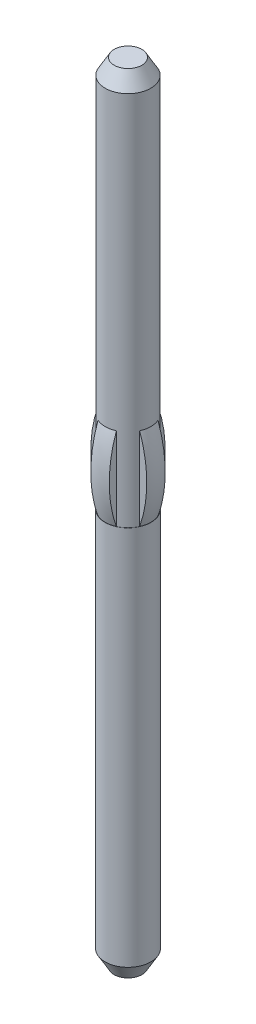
ISO-10303-21;
HEADER;
FILE_DESCRIPTION(('STEP AP214'),'2;1');
FILE_NAME('part.step','',(''),(''),'','','');
FILE_SCHEMA(('AUTOMOTIVE_DESIGN { 1 0 10303 214 1 1 1 1 }'));
ENDSEC;
DATA;
#1=APPLICATION_CONTEXT('core data for automotive mechanical design processes');
#2=APPLICATION_PROTOCOL_DEFINITION('international standard','automotive_design',2000,#1);
#3=PRODUCT_CONTEXT('',#1,'mechanical');
#4=PRODUCT('Part','Part','',(#3));
#5=PRODUCT_RELATED_PRODUCT_CATEGORY('part','',(#4));
#6=PRODUCT_DEFINITION_FORMATION('','',#4);
#7=PRODUCT_DEFINITION_CONTEXT('part definition',#1,'design');
#8=PRODUCT_DEFINITION('design','',#6,#7);
#9=PRODUCT_DEFINITION_SHAPE('','',#8);
#10=(LENGTH_UNIT() NAMED_UNIT(*) SI_UNIT(.MILLI.,.METRE.));
#11=(NAMED_UNIT(*) PLANE_ANGLE_UNIT() SI_UNIT($,.RADIAN.));
#12=(NAMED_UNIT(*) SI_UNIT($,.STERADIAN.) SOLID_ANGLE_UNIT());
#13=UNCERTAINTY_MEASURE_WITH_UNIT(LENGTH_MEASURE(1.E-05),#10,'distance_accuracy_value','');
#14=(GEOMETRIC_REPRESENTATION_CONTEXT(3) GLOBAL_UNCERTAINTY_ASSIGNED_CONTEXT((#13)) GLOBAL_UNIT_ASSIGNED_CONTEXT((#10,
#11,#12)) REPRESENTATION_CONTEXT('',''));
#15=CARTESIAN_POINT('',(0.,0.,0.));
#16=DIRECTION('',(0.,0.,1.));
#17=DIRECTION('',(1.,0.,0.));
#18=AXIS2_PLACEMENT_3D('',#15,#16,#17);
#19=CARTESIAN_POINT('',(-1.837552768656,-3.652,-0.8375527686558));
#20=DIRECTION('',(0.,-1.,0.));
#21=DIRECTION('',(-1.,0.,0.));
#22=AXIS2_PLACEMENT_3D('',#19,#20,#21);
#23=PLANE('',#22);
#24=CARTESIAN_POINT('',(-2.,-3.65200000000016,-1.));
#25=DIRECTION('',(0.,1.,0.));
#26=DIRECTION('',(0.,0.,1.));
#27=AXIS2_PLACEMENT_3D('',#24,#25,#26);
#28=CIRCLE('',#27,0.151154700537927);
#29=CARTESIAN_POINT('',(-2.,-3.65200000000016,-0.848845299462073));
#30=VERTEX_POINT('',#29);
#31=EDGE_CURVE('E21',#30,#30,#28,.F.);
#32=ORIENTED_EDGE('',*,*,#31,.T.);
#33=EDGE_LOOP('',(#32));
#34=FACE_BOUND('',#33,.T.);
#35=ADVANCED_FACE('F16',(#34),#23,.T.);
#36=CARTESIAN_POINT('',(-2.,-3.48252697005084,-1.));
#37=DIRECTION('',(0.,1.,0.));
#38=DIRECTION('',(0.,0.,1.));
#39=AXIS2_PLACEMENT_3D('',#36,#37,#38);
#40=CONICAL_SURFACE('',#39,0.249000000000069,0.523598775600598);
#41=ORIENTED_EDGE('',*,*,#31,.F.);
#42=EDGE_LOOP('',(#41));
#43=FACE_BOUND('',#42,.T.);
#44=CARTESIAN_POINT('',(-2.,-3.48252697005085,-1.));
#45=DIRECTION('',(0.,-1.,0.));
#46=DIRECTION('',(-1.,0.,0.));
#47=AXIS2_PLACEMENT_3D('',#44,#45,#46);
#48=CIRCLE('',#47,0.249);
#49=CARTESIAN_POINT('',(-2.249,-3.48252697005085,-1.));
#50=VERTEX_POINT('',#49);
#51=EDGE_CURVE('E88',#50,#50,#48,.T.);
#52=ORIENTED_EDGE('',*,*,#51,.T.);
#53=EDGE_LOOP('',(#52));
#54=FACE_BOUND('',#53,.T.);
#55=ADVANCED_FACE('F287',(#43,#54),#40,.T.);
#56=CARTESIAN_POINT('',(-2.,0.649999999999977,-1.));
#57=DIRECTION('',(0.,-1.,0.));
#58=DIRECTION('',(0.,0.,-1.));
#59=AXIS2_PLACEMENT_3D('',#56,#57,#58);
#60=CYLINDRICAL_SURFACE('',#59,0.249);
#61=ORIENTED_EDGE('',*,*,#51,.F.);
#62=EDGE_LOOP('',(#61));
#63=FACE_BOUND('',#62,.T.);
#64=CARTESIAN_POINT('',(-2.,0.649999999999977,-1.));
#65=DIRECTION('',(0.,-1.,0.));
#66=DIRECTION('',(0.,0.,-1.));
#67=AXIS2_PLACEMENT_3D('',#64,#65,#66);
#68=CIRCLE('',#67,0.249);
#69=CARTESIAN_POINT('',(-2.,0.649999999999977,-1.249));
#70=VERTEX_POINT('',#69);
#71=EDGE_CURVE('E97',#70,#70,#68,.T.);
#72=ORIENTED_EDGE('',*,*,#71,.T.);
#73=EDGE_LOOP('',(#72));
#74=FACE_BOUND('',#73,.T.);
#75=ADVANCED_FACE('F188',(#63,#74),#60,.T.);
#76=CARTESIAN_POINT('',(-1.838707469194,4.9,-0.8387074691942));
#77=DIRECTION('',(0.,-1.,0.));
#78=DIRECTION('',(-1.,0.,0.));
#79=AXIS2_PLACEMENT_3D('',#76,#77,#78);
#80=PLANE('',#79);
#81=CARTESIAN_POINT('',(-2.,4.90000000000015,-1.));
#82=DIRECTION('',(0.,-1.,0.));
#83=DIRECTION('',(0.,0.,-1.));
#84=AXIS2_PLACEMENT_3D('',#81,#82,#83);
#85=CIRCLE('',#84,0.149999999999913);
#86=CARTESIAN_POINT('',(-2.,4.90000000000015,-1.14999999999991));
#87=VERTEX_POINT('',#86);
#88=EDGE_CURVE('E112',#87,#87,#85,.F.);
#89=ORIENTED_EDGE('',*,*,#88,.T.);
#90=EDGE_LOOP('',(#89));
#91=FACE_BOUND('',#90,.T.);
#92=ADVANCED_FACE('F204',(#91),#80,.F.);
#93=CARTESIAN_POINT('',(-2.1,0.632,-1.316205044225));
#94=DIRECTION('',(-1.,0.,0.));
#95=DIRECTION('',(0.,0.,1.));
#96=AXIS2_PLACEMENT_3D('',#93,#94,#95);
#97=PLANE('',#96);
#98=CARTESIAN_POINT('',(-2.1,1.55000000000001,-1.22585172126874));
#99=CARTESIAN_POINT('',(-2.1,1.51965051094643,-1.23689793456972));
#100=CARTESIAN_POINT('',(-2.1,1.488886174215,-1.24674874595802));
#101=CARTESIAN_POINT('',(-2.1,1.42670779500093,-1.26409520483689));
#102=CARTESIAN_POINT('',(-2.1,1.39529391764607,-1.27159144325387));
#103=CARTESIAN_POINT('',(-2.1,1.30028075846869,-1.29061791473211));
#104=CARTESIAN_POINT('',(-2.09999999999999,1.23595243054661,-1.29867071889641));
#105=CARTESIAN_POINT('',(-2.09999999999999,1.10690786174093,-1.30549979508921));
#106=CARTESIAN_POINT('',(-2.1,1.04219206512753,-1.30428519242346));
#107=CARTESIAN_POINT('',(-2.1,0.913659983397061,-1.29261122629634));
#108=CARTESIAN_POINT('',(-2.1,0.849842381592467,-1.28216723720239));
#109=CARTESIAN_POINT('',(-2.1,0.763950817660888,-1.26150969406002));
#110=CARTESIAN_POINT('',(-2.1,0.740869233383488,-1.25528335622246));
#111=CARTESIAN_POINT('',(-2.1,0.69511584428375,-1.24154066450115));
#112=CARTESIAN_POINT('',(-2.1,0.672443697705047,-1.23402544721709));
#113=CARTESIAN_POINT('',(-2.1,0.649999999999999,-1.22585172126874));
#114=B_SPLINE_CURVE_WITH_KNOTS('',3,(#98,#99,#100,#101,#102,#103,#104,#105,#106,#107,#108,#109,
#110,#111,#112,#113),.UNSPECIFIED.,.F.,.F.,(4,2,2,2,2,2,2,4),(0.,0.096832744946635,
0.193641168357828,0.387392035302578,0.580952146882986,0.774190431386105,0.845880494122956,
0.917507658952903),.UNSPECIFIED.);
#115=CARTESIAN_POINT('',(-2.10000000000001,1.54999999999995,-1.22585172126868));
#116=VERTEX_POINT('',#115);
#117=CARTESIAN_POINT('',(-2.10000000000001,0.650000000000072,-1.22585172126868));
#118=VERTEX_POINT('',#117);
#119=EDGE_CURVE('E80',#116,#118,#114,.T.);
#120=ORIENTED_EDGE('',*,*,#119,.T.);
#121=DIRECTION('',(0.,1.,0.));
#122=VECTOR('',#121,1.);
#123=CARTESIAN_POINT('',(-2.10000000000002,2.69099553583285,-1.22585172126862));
#124=LINE('',#123,#122);
#125=EDGE_CURVE('E86',#118,#116,#124,.T.);
#126=ORIENTED_EDGE('',*,*,#125,.T.);
#127=EDGE_LOOP('',(#120,#126));
#128=FACE_BOUND('',#127,.T.);
#129=ADVANCED_FACE('F84',(#128),#97,.T.);
#130=CARTESIAN_POINT('',(-0.8965136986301,1.1,-1.));
#131=DIRECTION('',(0.,0.,1.));
#132=DIRECTION('',(-0.94457187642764,0.328304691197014,0.));
#133=AXIS2_PLACEMENT_3D('',#130,#131,#132);
#134=CIRCLE('',#133,1.42348630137);
#135=TRIMMED_CURVE('',#134,(PARAMETER_VALUE(-0.349256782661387)),
(PARAMETER_VALUE(1.01827322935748)),.T.,.PARAMETER.);
#136=CARTESIAN_POINT('',(-2.,1.1,-1.));
#137=DIRECTION('',(0.,-1.,0.));
#138=AXIS1_PLACEMENT('',#136,#137);
#139=SURFACE_OF_REVOLUTION('',#135,#138);
#140=CARTESIAN_POINT('',(-2.,1.54999999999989,-1.));
#141=DIRECTION('',(0.,-1.,0.));
#142=DIRECTION('',(-1.,0.,0.));
#143=AXIS2_PLACEMENT_3D('',#140,#141,#142);
#144=CIRCLE('',#143,0.247);
#145=CARTESIAN_POINT('',(-1.89999999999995,1.54999999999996,-1.22585172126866));
#146=VERTEX_POINT('',#145);
#147=EDGE_CURVE('E106',#116,#146,#144,.T.);
#148=ORIENTED_EDGE('',*,*,#147,.T.);
#149=CARTESIAN_POINT('',(-1.9,1.55000000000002,-1.22585172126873));
#150=CARTESIAN_POINT('',(-1.9,1.51965051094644,-1.23689793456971));
#151=CARTESIAN_POINT('',(-1.9,1.48888617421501,-1.24674874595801));
#152=CARTESIAN_POINT('',(-1.9,1.42670779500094,-1.26409520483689));
#153=CARTESIAN_POINT('',(-1.9,1.39529391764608,-1.27159144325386));
#154=CARTESIAN_POINT('',(-1.9,1.30028075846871,-1.29061791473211));
#155=CARTESIAN_POINT('',(-1.90000000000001,1.23595243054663,-1.29867071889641));
#156=CARTESIAN_POINT('',(-1.90000000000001,1.10690786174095,-1.30549979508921));
#157=CARTESIAN_POINT('',(-1.9,1.04219206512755,-1.30428519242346));
#158=CARTESIAN_POINT('',(-1.9,0.913659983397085,-1.29261122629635));
#159=CARTESIAN_POINT('',(-1.9,0.849842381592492,-1.2821672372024));
#160=CARTESIAN_POINT('',(-1.9,0.763950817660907,-1.26150969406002));
#161=CARTESIAN_POINT('',(-1.9,0.740869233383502,-1.25528335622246));
#162=CARTESIAN_POINT('',(-1.9,0.695115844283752,-1.24154066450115));
#163=CARTESIAN_POINT('',(-1.9,0.672443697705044,-1.23402544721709));
#164=CARTESIAN_POINT('',(-1.9,0.649999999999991,-1.22585172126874));
#165=B_SPLINE_CURVE_WITH_KNOTS('',3,(#149,#150,#151,#152,#153,#154,#155,#156,#157,#158,#159,
#160,#161,#162,#163,#164),.UNSPECIFIED.,.F.,.F.,(4,2,2,2,2,2,2,4),(0.,0.096832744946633,
0.193641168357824,0.387392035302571,0.580952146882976,0.774190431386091,0.84588049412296,
0.917507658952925),.UNSPECIFIED.);
#166=CARTESIAN_POINT('',(-1.89999999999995,0.650000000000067,-1.22585172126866));
#167=VERTEX_POINT('',#166);
#168=EDGE_CURVE('E87',#146,#167,#165,.T.);
#169=ORIENTED_EDGE('',*,*,#168,.T.);
#170=CARTESIAN_POINT('',(-2.,0.65,-1.));
#171=DIRECTION('',(0.,-1.,0.));
#172=DIRECTION('',(0.,0.,-1.));
#173=AXIS2_PLACEMENT_3D('',#170,#171,#172);
#174=CIRCLE('',#173,0.247000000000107);
#175=EDGE_CURVE('E90',#167,#118,#174,.F.);
#176=ORIENTED_EDGE('',*,*,#175,.T.);
#177=ORIENTED_EDGE('',*,*,#119,.F.);
#178=EDGE_LOOP('',(#148,#169,#176,#177));
#179=FACE_BOUND('',#178,.T.);
#180=ADVANCED_FACE('F91',(#179),#139,.T.);
#181=CARTESIAN_POINT('',(-1.9,0.632,-1.316205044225));
#182=DIRECTION('',(-1.,0.,0.));
#183=DIRECTION('',(0.,0.,1.));
#184=AXIS2_PLACEMENT_3D('',#181,#182,#183);
#185=PLANE('',#184);
#186=ORIENTED_EDGE('',*,*,#168,.F.);
#187=DIRECTION('',(0.,-1.,0.));
#188=VECTOR('',#187,1.);
#189=CARTESIAN_POINT('',(-1.8999999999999,2.69099553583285,-1.22585172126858));
#190=LINE('',#189,#188);
#191=EDGE_CURVE('E178',#146,#167,#190,.T.);
#192=ORIENTED_EDGE('',*,*,#191,.T.);
#193=EDGE_LOOP('',(#186,#192));
#194=FACE_BOUND('',#193,.T.);
#195=ADVANCED_FACE('F187',(#194),#185,.F.);
#196=CARTESIAN_POINT('',(-2.214559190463,0.632,-1.1));
#197=DIRECTION('',(0.,0.,-1.));
#198=DIRECTION('',(-1.,0.,0.));
#199=AXIS2_PLACEMENT_3D('',#196,#197,#198);
#200=PLANE('',#199);
#201=CARTESIAN_POINT('',(-2.22585172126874,0.649999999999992,-1.1));
#202=CARTESIAN_POINT('',(-2.23689793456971,0.680349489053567,-1.1));
#203=CARTESIAN_POINT('',(-2.24674874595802,0.711113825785,-1.1));
#204=CARTESIAN_POINT('',(-2.26409520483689,0.773292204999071,-1.1));
#205=CARTESIAN_POINT('',(-2.27159144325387,0.804706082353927,-1.1));
#206=CARTESIAN_POINT('',(-2.29061791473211,0.899719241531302,-1.1));
#207=CARTESIAN_POINT('',(-2.29867071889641,0.964047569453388,-1.09999999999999));
#208=CARTESIAN_POINT('',(-2.30549979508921,1.09309213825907,-1.09999999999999));
#209=CARTESIAN_POINT('',(-2.30428519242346,1.15780793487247,-1.1));
#210=CARTESIAN_POINT('',(-2.29261122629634,1.28634001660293,-1.1));
#211=CARTESIAN_POINT('',(-2.28216723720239,1.35015761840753,-1.1));
#212=CARTESIAN_POINT('',(-2.26150969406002,1.43604918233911,-1.1));
#213=CARTESIAN_POINT('',(-2.25528335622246,1.45913076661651,-1.1));
#214=CARTESIAN_POINT('',(-2.24154066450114,1.50488415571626,-1.1));
#215=CARTESIAN_POINT('',(-2.23402544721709,1.52755630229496,-1.1));
#216=CARTESIAN_POINT('',(-2.22585172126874,1.55000000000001,-1.1));
#217=B_SPLINE_CURVE_WITH_KNOTS('',3,(#201,#202,#203,#204,#205,#206,#207,#208,#209,#210,#211,
#212,#213,#214,#215,#216),.UNSPECIFIED.,.F.,.F.,(4,2,2,2,2,2,2,4),(0.,0.0968327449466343,
0.193641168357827,0.387392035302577,0.580952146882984,0.774190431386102,0.845880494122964,
0.917507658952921),.UNSPECIFIED.);
#218=CARTESIAN_POINT('',(-2.22585172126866,0.650000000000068,-1.10000000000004));
#219=VERTEX_POINT('',#218);
#220=CARTESIAN_POINT('',(-2.22585172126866,1.54999999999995,-1.10000000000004));
#221=VERTEX_POINT('',#220);
#222=EDGE_CURVE('E127',#219,#221,#217,.T.);
#223=ORIENTED_EDGE('',*,*,#222,.T.);
#224=DIRECTION('',(0.,-1.,0.));
#225=VECTOR('',#224,1.);
#226=CARTESIAN_POINT('',(-2.22585172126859,2.69099553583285,-1.10000000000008));
#227=LINE('',#226,#225);
#228=EDGE_CURVE('E174',#221,#219,#227,.T.);
#229=ORIENTED_EDGE('',*,*,#228,.T.);
#230=EDGE_LOOP('',(#223,#229));
#231=FACE_BOUND('',#230,.T.);
#232=ADVANCED_FACE('F208',(#231),#200,.T.);
#233=CARTESIAN_POINT('',(-1.785440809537,0.632,-1.1));
#234=DIRECTION('',(0.,0.,1.));
#235=DIRECTION('',(1.,0.,0.));
#236=AXIS2_PLACEMENT_3D('',#233,#234,#235);
#237=PLANE('',#236);
#238=CARTESIAN_POINT('',(-1.77414827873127,1.55000000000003,-1.1));
#239=CARTESIAN_POINT('',(-1.76310206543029,1.51965051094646,-1.1));
#240=CARTESIAN_POINT('',(-1.75325125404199,1.48888617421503,-1.1));
#241=CARTESIAN_POINT('',(-1.73590479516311,1.42670779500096,-1.1));
#242=CARTESIAN_POINT('',(-1.72840855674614,1.3952939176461,-1.1));
#243=CARTESIAN_POINT('',(-1.7093820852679,1.30028075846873,-1.1));
#244=CARTESIAN_POINT('',(-1.70132928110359,1.23595243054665,-1.09999999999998));
#245=CARTESIAN_POINT('',(-1.69450020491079,1.10690786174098,-1.09999999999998));
#246=CARTESIAN_POINT('',(-1.69571480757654,1.04219206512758,-1.1));
#247=CARTESIAN_POINT('',(-1.70738877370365,0.913659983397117,-1.1));
#248=CARTESIAN_POINT('',(-1.7178327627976,0.849842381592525,-1.1));
#249=CARTESIAN_POINT('',(-1.73849030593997,0.763950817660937,-1.1));
#250=CARTESIAN_POINT('',(-1.74471664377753,0.740869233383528,-1.1));
#251=CARTESIAN_POINT('',(-1.75845933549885,0.69511584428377,-1.1));
#252=CARTESIAN_POINT('',(-1.7659745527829,0.672443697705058,-1.1));
#253=CARTESIAN_POINT('',(-1.77414827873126,0.650000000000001,-1.1));
#254=B_SPLINE_CURVE_WITH_KNOTS('',3,(#238,#239,#240,#241,#242,#243,#244,#245,#246,#247,#248,
#249,#250,#251,#252,#253),.UNSPECIFIED.,.F.,.F.,(4,2,2,2,2,2,2,4),(0.,0.0968327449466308,
0.19364116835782,0.387392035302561,0.580952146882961,0.774190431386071,0.845880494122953,
0.91750765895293),.UNSPECIFIED.);
#255=CARTESIAN_POINT('',(-1.77414827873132,1.54999999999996,-1.1));
#256=VERTEX_POINT('',#255);
#257=CARTESIAN_POINT('',(-1.77414827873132,0.650000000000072,-1.1));
#258=VERTEX_POINT('',#257);
#259=EDGE_CURVE('E223',#256,#258,#254,.T.);
#260=ORIENTED_EDGE('',*,*,#259,.T.);
#261=DIRECTION('',(0.,1.,0.));
#262=VECTOR('',#261,1.);
#263=CARTESIAN_POINT('',(-1.77414827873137,2.69099553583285,-1.09999999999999));
#264=LINE('',#263,#262);
#265=EDGE_CURVE('E171',#258,#256,#264,.T.);
#266=ORIENTED_EDGE('',*,*,#265,.T.);
#267=EDGE_LOOP('',(#260,#266));
#268=FACE_BOUND('',#267,.T.);
#269=ADVANCED_FACE('F213',(#268),#237,.F.);
#270=CARTESIAN_POINT('',(-1.9,0.632,-0.6837949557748));
#271=DIRECTION('',(1.,0.,0.));
#272=DIRECTION('',(0.,0.,-1.));
#273=AXIS2_PLACEMENT_3D('',#270,#271,#272);
#274=PLANE('',#273);
#275=CARTESIAN_POINT('',(-1.9,1.55,-0.774148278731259));
#276=CARTESIAN_POINT('',(-1.9,1.51965051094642,-0.763102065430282));
#277=CARTESIAN_POINT('',(-1.9,1.48888617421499,-0.753251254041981));
#278=CARTESIAN_POINT('',(-1.9,1.42670779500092,-0.735904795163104));
#279=CARTESIAN_POINT('',(-1.9,1.39529391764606,-0.72840855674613));
#280=CARTESIAN_POINT('',(-1.9,1.30028075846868,-0.709382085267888));
#281=CARTESIAN_POINT('',(-1.90000000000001,1.2359524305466,-0.701329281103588));
#282=CARTESIAN_POINT('',(-1.90000000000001,1.10690786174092,-0.694500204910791));
#283=CARTESIAN_POINT('',(-1.9,1.04219206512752,-0.695714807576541));
#284=CARTESIAN_POINT('',(-1.9,0.913659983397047,-0.707388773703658));
#285=CARTESIAN_POINT('',(-1.9,0.849842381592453,-0.71783276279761));
#286=CARTESIAN_POINT('',(-1.9,0.763950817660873,-0.738490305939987));
#287=CARTESIAN_POINT('',(-1.9,0.740869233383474,-0.744716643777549));
#288=CARTESIAN_POINT('',(-1.9,0.695115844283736,-0.758459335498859));
#289=CARTESIAN_POINT('',(-1.9,0.672443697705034,-0.76597455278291));
#290=CARTESIAN_POINT('',(-1.9,0.649999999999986,-0.774148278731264));
#291=B_SPLINE_CURVE_WITH_KNOTS('',3,(#275,#276,#277,#278,#279,#280,#281,#282,#283,#284,#285,
#286,#287,#288,#289,#290),.UNSPECIFIED.,.F.,.F.,(4,2,2,2,2,2,2,4),(0.,0.0968327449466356,
0.19364116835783,0.387392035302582,0.580952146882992,0.774190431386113,0.845880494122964,
0.917507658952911),.UNSPECIFIED.);
#292=CARTESIAN_POINT('',(-1.90000000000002,1.54999999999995,-0.774148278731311));
#293=VERTEX_POINT('',#292);
#294=CARTESIAN_POINT('',(-1.90000000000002,0.650000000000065,-0.774148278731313));
#295=VERTEX_POINT('',#294);
#296=EDGE_CURVE('E258',#293,#295,#291,.T.);
#297=ORIENTED_EDGE('',*,*,#296,.T.);
#298=DIRECTION('',(0.,1.,0.));
#299=VECTOR('',#298,1.);
#300=CARTESIAN_POINT('',(-1.90000000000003,2.69099553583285,-0.774148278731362));
#301=LINE('',#300,#299);
#302=EDGE_CURVE('E165',#295,#293,#301,.T.);
#303=ORIENTED_EDGE('',*,*,#302,.T.);
#304=EDGE_LOOP('',(#297,#303));
#305=FACE_BOUND('',#304,.T.);
#306=ADVANCED_FACE('F218',(#305),#274,.T.);
#307=CARTESIAN_POINT('',(-0.8965136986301,1.1,-1.));
#308=DIRECTION('',(0.,0.,1.));
#309=DIRECTION('',(-0.94457187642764,0.328304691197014,0.));
#310=AXIS2_PLACEMENT_3D('',#307,#308,#309);
#311=CIRCLE('',#310,1.42348630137);
#312=TRIMMED_CURVE('',#311,(PARAMETER_VALUE(-0.349256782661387)),
(PARAMETER_VALUE(1.01827322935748)),.T.,.PARAMETER.);
#313=CARTESIAN_POINT('',(-2.,1.1,-1.));
#314=DIRECTION('',(0.,-1.,0.));
#315=AXIS1_PLACEMENT('',#313,#314);
#316=SURFACE_OF_REVOLUTION('',#312,#315);
#317=CARTESIAN_POINT('',(-2.,1.54999999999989,-1.));
#318=DIRECTION('',(0.,-1.,0.));
#319=DIRECTION('',(-1.,0.,0.));
#320=AXIS2_PLACEMENT_3D('',#317,#318,#319);
#321=CIRCLE('',#320,0.247);
#322=CARTESIAN_POINT('',(-2.09999999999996,1.54999999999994,-0.774148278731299));
#323=VERTEX_POINT('',#322);
#324=EDGE_CURVE('E163',#293,#323,#321,.T.);
#325=ORIENTED_EDGE('',*,*,#324,.T.);
#326=CARTESIAN_POINT('',(-2.1,1.54999999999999,-0.774148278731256));
#327=CARTESIAN_POINT('',(-2.1,1.51965051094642,-0.763102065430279));
#328=CARTESIAN_POINT('',(-2.1,1.48888617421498,-0.753251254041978));
#329=CARTESIAN_POINT('',(-2.1,1.42670779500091,-0.735904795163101));
#330=CARTESIAN_POINT('',(-2.1,1.39529391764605,-0.728408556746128));
#331=CARTESIAN_POINT('',(-2.1,1.30028075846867,-0.709382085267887));
#332=CARTESIAN_POINT('',(-2.09999999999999,1.23595243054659,-0.701329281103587));
#333=CARTESIAN_POINT('',(-2.09999999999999,1.1069078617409,-0.694500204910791));
#334=CARTESIAN_POINT('',(-2.1,1.0421920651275,-0.695714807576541));
#335=CARTESIAN_POINT('',(-2.1,0.913659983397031,-0.70738877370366));
#336=CARTESIAN_POINT('',(-2.1,0.849842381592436,-0.717832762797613));
#337=CARTESIAN_POINT('',(-2.1,0.763950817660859,-0.73849030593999));
#338=CARTESIAN_POINT('',(-2.1,0.740869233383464,-0.744716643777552));
#339=CARTESIAN_POINT('',(-2.1,0.695115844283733,-0.75845933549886));
#340=CARTESIAN_POINT('',(-2.1,0.672443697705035,-0.76597455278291));
#341=CARTESIAN_POINT('',(-2.1,0.649999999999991,-0.774148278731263));
#342=B_SPLINE_CURVE_WITH_KNOTS('',3,(#326,#327,#328,#329,#330,#331,#332,#333,#334,#335,#336,
#337,#338,#339,#340,#341),.UNSPECIFIED.,.F.,.F.,(4,2,2,2,2,2,2,4),(0.,0.0968327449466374,
0.193641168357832,0.387392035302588,0.580952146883,0.774190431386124,0.845880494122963,
0.917507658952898),.UNSPECIFIED.);
#343=CARTESIAN_POINT('',(-2.09999999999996,0.650000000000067,-0.774148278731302));
#344=VERTEX_POINT('',#343);
#345=EDGE_CURVE('E253',#323,#344,#342,.T.);
#346=ORIENTED_EDGE('',*,*,#345,.T.);
#347=CARTESIAN_POINT('',(-2.,0.65,-1.));
#348=DIRECTION('',(0.,-1.,0.));
#349=DIRECTION('',(0.,0.,-1.));
#350=AXIS2_PLACEMENT_3D('',#347,#348,#349);
#351=CIRCLE('',#350,0.247000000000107);
#352=EDGE_CURVE('E96',#344,#295,#351,.F.);
#353=ORIENTED_EDGE('',*,*,#352,.T.);
#354=ORIENTED_EDGE('',*,*,#296,.F.);
#355=EDGE_LOOP('',(#325,#346,#353,#354));
#356=FACE_BOUND('',#355,.T.);
#357=ADVANCED_FACE('F145',(#356),#316,.T.);
#358=CARTESIAN_POINT('',(-2.1,0.632,-0.6837949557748));
#359=DIRECTION('',(1.,0.,0.));
#360=DIRECTION('',(0.,0.,-1.));
#361=AXIS2_PLACEMENT_3D('',#358,#359,#360);
#362=PLANE('',#361);
#363=ORIENTED_EDGE('',*,*,#345,.F.);
#364=DIRECTION('',(0.,-1.,0.));
#365=VECTOR('',#364,1.);
#366=CARTESIAN_POINT('',(-2.09999999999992,2.69099553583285,-0.774148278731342));
#367=LINE('',#366,#365);
#368=EDGE_CURVE('E160',#323,#344,#367,.T.);
#369=ORIENTED_EDGE('',*,*,#368,.T.);
#370=EDGE_LOOP('',(#363,#369));
#371=FACE_BOUND('',#370,.T.);
#372=ADVANCED_FACE('F262',(#371),#362,.F.);
#373=CARTESIAN_POINT('',(-1.739707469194,0.65,-0.7397074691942));
#374=DIRECTION('',(0.,-1.,0.));
#375=DIRECTION('',(-1.,0.,0.));
#376=AXIS2_PLACEMENT_3D('',#373,#374,#375);
#377=PLANE('',#376);
#378=ORIENTED_EDGE('',*,*,#352,.F.);
#379=CARTESIAN_POINT('',(-2.,0.650000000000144,-1.));
#380=DIRECTION('',(0.,-1.,0.));
#381=DIRECTION('',(0.,0.,-1.));
#382=AXIS2_PLACEMENT_3D('',#379,#380,#381);
#383=CIRCLE('',#382,0.247);
#384=CARTESIAN_POINT('',(-2.22585172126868,0.650000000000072,-0.9));
#385=VERTEX_POINT('',#384);
#386=EDGE_CURVE('E159',#344,#385,#383,.T.);
#387=ORIENTED_EDGE('',*,*,#386,.T.);
#388=CARTESIAN_POINT('',(-2.,0.65,-1.));
#389=DIRECTION('',(0.,-1.,0.));
#390=DIRECTION('',(0.,0.,-1.));
#391=AXIS2_PLACEMENT_3D('',#388,#389,#390);
#392=CIRCLE('',#391,0.247000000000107);
#393=EDGE_CURVE('E111',#385,#219,#392,.T.);
#394=ORIENTED_EDGE('',*,*,#393,.T.);
#395=CARTESIAN_POINT('',(-2.,0.650000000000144,-1.));
#396=DIRECTION('',(0.,-1.,0.));
#397=DIRECTION('',(0.,0.,-1.));
#398=AXIS2_PLACEMENT_3D('',#395,#396,#397);
#399=CIRCLE('',#398,0.247);
#400=EDGE_CURVE('E103',#219,#118,#399,.T.);
#401=ORIENTED_EDGE('',*,*,#400,.T.);
#402=ORIENTED_EDGE('',*,*,#175,.F.);
#403=CARTESIAN_POINT('',(-2.,0.650000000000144,-1.));
#404=DIRECTION('',(0.,-1.,0.));
#405=DIRECTION('',(0.,0.,-1.));
#406=AXIS2_PLACEMENT_3D('',#403,#404,#405);
#407=CIRCLE('',#406,0.247);
#408=EDGE_CURVE('E118',#167,#258,#407,.T.);
#409=ORIENTED_EDGE('',*,*,#408,.T.);
#410=CARTESIAN_POINT('',(-2.,0.65,-1.));
#411=DIRECTION('',(0.,-1.,0.));
#412=DIRECTION('',(0.,0.,-1.));
#413=AXIS2_PLACEMENT_3D('',#410,#411,#412);
#414=CIRCLE('',#413,0.247000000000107);
#415=CARTESIAN_POINT('',(-1.77414827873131,0.650000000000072,-0.900000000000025));
#416=VERTEX_POINT('',#415);
#417=EDGE_CURVE('E177',#258,#416,#414,.T.);
#418=ORIENTED_EDGE('',*,*,#417,.T.);
#419=CARTESIAN_POINT('',(-2.,0.650000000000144,-1.));
#420=DIRECTION('',(0.,-1.,0.));
#421=DIRECTION('',(0.,0.,-1.));
#422=AXIS2_PLACEMENT_3D('',#419,#420,#421);
#423=CIRCLE('',#422,0.247);
#424=EDGE_CURVE('E170',#416,#295,#423,.T.);
#425=ORIENTED_EDGE('',*,*,#424,.T.);
#426=EDGE_LOOP('',(#378,#387,#394,#401,#402,#409,#418,#425));
#427=FACE_BOUND('',#426,.T.);
#428=ORIENTED_EDGE('',*,*,#71,.F.);
#429=EDGE_LOOP('',(#428));
#430=FACE_BOUND('',#429,.T.);
#431=ADVANCED_FACE('F108',(#427,#430),#377,.F.);
#432=CARTESIAN_POINT('',(-2.214559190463,0.632,-0.9));
#433=DIRECTION('',(0.,0.,-1.));
#434=DIRECTION('',(-1.,0.,0.));
#435=AXIS2_PLACEMENT_3D('',#432,#433,#434);
#436=PLANE('',#435);
#437=CARTESIAN_POINT('',(-2.22585172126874,1.55000000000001,-0.9));
#438=CARTESIAN_POINT('',(-2.23689793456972,1.51965051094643,-0.900000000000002));
#439=CARTESIAN_POINT('',(-2.24674874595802,1.488886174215,-0.900000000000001));
#440=CARTESIAN_POINT('',(-2.26409520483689,1.42670779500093,-0.899999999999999));
#441=CARTESIAN_POINT('',(-2.27159144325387,1.39529391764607,-0.899999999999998));
#442=CARTESIAN_POINT('',(-2.29061791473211,1.30028075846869,-0.900000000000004));
#443=CARTESIAN_POINT('',(-2.29867071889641,1.23595243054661,-0.900000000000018));
#444=CARTESIAN_POINT('',(-2.30549979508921,1.10690786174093,-0.900000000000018));
#445=CARTESIAN_POINT('',(-2.30428519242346,1.04219206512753,-0.900000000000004));
#446=CARTESIAN_POINT('',(-2.29261122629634,0.913659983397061,-0.899999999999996));
#447=CARTESIAN_POINT('',(-2.28216723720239,0.849842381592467,-0.900000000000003));
#448=CARTESIAN_POINT('',(-2.26150969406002,0.763950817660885,-0.900000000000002));
#449=CARTESIAN_POINT('',(-2.25528335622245,0.740869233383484,-0.900000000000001));
#450=CARTESIAN_POINT('',(-2.24154066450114,0.695115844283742,-0.899999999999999));
#451=CARTESIAN_POINT('',(-2.23402544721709,0.672443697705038,-0.899999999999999));
#452=CARTESIAN_POINT('',(-2.22585172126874,0.649999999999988,-0.9));
#453=B_SPLINE_CURVE_WITH_KNOTS('',3,(#437,#438,#439,#440,#441,#442,#443,#444,#445,#446,#447,
#448,#449,#450,#451,#452),.UNSPECIFIED.,.F.,.F.,(4,2,2,2,2,2,2,4),(0.,0.0968327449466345,
0.193641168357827,0.387392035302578,0.580952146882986,0.774190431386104,0.845880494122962,
0.917507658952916),.UNSPECIFIED.);
#454=CARTESIAN_POINT('',(-2.22585172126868,1.54999999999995,-0.900000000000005));
#455=VERTEX_POINT('',#454);
#456=EDGE_CURVE('E115',#455,#385,#453,.T.);
#457=ORIENTED_EDGE('',*,*,#456,.T.);
#458=DIRECTION('',(0.,1.,0.));
#459=VECTOR('',#458,1.);
#460=CARTESIAN_POINT('',(-2.22585172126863,2.69099553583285,-0.90000000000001));
#461=LINE('',#460,#459);
#462=EDGE_CURVE('E155',#385,#455,#461,.T.);
#463=ORIENTED_EDGE('',*,*,#462,.T.);
#464=EDGE_LOOP('',(#457,#463));
#465=FACE_BOUND('',#464,.T.);
#466=ADVANCED_FACE('F133',(#465),#436,.F.);
#467=CARTESIAN_POINT('',(-0.8965136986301,1.1,-1.));
#468=DIRECTION('',(0.,0.,1.));
#469=DIRECTION('',(-0.94457187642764,0.328304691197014,0.));
#470=AXIS2_PLACEMENT_3D('',#467,#468,#469);
#471=CIRCLE('',#470,1.42348630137);
#472=TRIMMED_CURVE('',#471,(PARAMETER_VALUE(-0.349256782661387)),
(PARAMETER_VALUE(1.01827322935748)),.T.,.PARAMETER.);
#473=CARTESIAN_POINT('',(-2.,1.1,-1.));
#474=DIRECTION('',(0.,-1.,0.));
#475=AXIS1_PLACEMENT('',#473,#474);
#476=SURFACE_OF_REVOLUTION('',#472,#475);
#477=CARTESIAN_POINT('',(-2.,1.54999999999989,-1.));
#478=DIRECTION('',(0.,-1.,0.));
#479=DIRECTION('',(-1.,0.,0.));
#480=AXIS2_PLACEMENT_3D('',#477,#478,#479);
#481=CIRCLE('',#480,0.247);
#482=EDGE_CURVE('E158',#455,#221,#481,.T.);
#483=ORIENTED_EDGE('',*,*,#482,.T.);
#484=ORIENTED_EDGE('',*,*,#222,.F.);
#485=ORIENTED_EDGE('',*,*,#393,.F.);
#486=ORIENTED_EDGE('',*,*,#456,.F.);
#487=EDGE_LOOP('',(#483,#484,#485,#486));
#488=FACE_BOUND('',#487,.T.);
#489=ADVANCED_FACE('F136',(#488),#476,.T.);
#490=CARTESIAN_POINT('',(-2.,4.90000000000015,-1.));
#491=DIRECTION('',(0.,-1.,0.));
#492=DIRECTION('',(0.,0.,-1.));
#493=AXIS2_PLACEMENT_3D('',#490,#491,#492);
#494=CONICAL_SURFACE('',#493,0.149999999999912,0.523598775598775);
#495=CARTESIAN_POINT('',(-2.,4.73199107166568,-1.));
#496=DIRECTION('',(0.,-1.,0.));
#497=DIRECTION('',(-1.,0.,0.));
#498=AXIS2_PLACEMENT_3D('',#495,#496,#497);
#499=CIRCLE('',#498,0.247);
#500=CARTESIAN_POINT('',(-2.247,4.73199107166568,-1.));
#501=VERTEX_POINT('',#500);
#502=EDGE_CURVE('E243',#501,#501,#499,.F.);
#503=ORIENTED_EDGE('',*,*,#502,.T.);
#504=EDGE_LOOP('',(#503));
#505=FACE_BOUND('',#504,.T.);
#506=ORIENTED_EDGE('',*,*,#88,.F.);
#507=EDGE_LOOP('',(#506));
#508=FACE_BOUND('',#507,.T.);
#509=ADVANCED_FACE('F142',(#505,#508),#494,.T.);
#510=CARTESIAN_POINT('',(-0.8965136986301,1.1,-1.));
#511=DIRECTION('',(0.,0.,1.));
#512=DIRECTION('',(-0.94457187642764,0.328304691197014,0.));
#513=AXIS2_PLACEMENT_3D('',#510,#511,#512);
#514=CIRCLE('',#513,1.42348630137);
#515=TRIMMED_CURVE('',#514,(PARAMETER_VALUE(-0.349256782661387)),
(PARAMETER_VALUE(1.01827322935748)),.T.,.PARAMETER.);
#516=CARTESIAN_POINT('',(-2.,1.1,-1.));
#517=DIRECTION('',(0.,-1.,0.));
#518=AXIS1_PLACEMENT('',#516,#517);
#519=SURFACE_OF_REVOLUTION('',#515,#518);
#520=ORIENTED_EDGE('',*,*,#259,.F.);
#521=CARTESIAN_POINT('',(-2.,1.54999999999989,-1.));
#522=DIRECTION('',(0.,-1.,0.));
#523=DIRECTION('',(-1.,0.,0.));
#524=AXIS2_PLACEMENT_3D('',#521,#522,#523);
#525=CIRCLE('',#524,0.247);
#526=CARTESIAN_POINT('',(-1.77414827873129,1.54999999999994,-0.900000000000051));
#527=VERTEX_POINT('',#526);
#528=EDGE_CURVE('E27',#256,#527,#525,.T.);
#529=ORIENTED_EDGE('',*,*,#528,.T.);
#530=CARTESIAN_POINT('',(-1.77414827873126,0.650000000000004,-0.9));
#531=CARTESIAN_POINT('',(-1.76310206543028,0.680349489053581,-0.900000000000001));
#532=CARTESIAN_POINT('',(-1.75325125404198,0.711113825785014,-0.9));
#533=CARTESIAN_POINT('',(-1.7359047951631,0.773292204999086,-0.9));
#534=CARTESIAN_POINT('',(-1.72840855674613,0.804706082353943,-0.899999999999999));
#535=CARTESIAN_POINT('',(-1.70938208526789,0.899719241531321,-0.900000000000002));
#536=CARTESIAN_POINT('',(-1.70132928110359,0.964047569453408,-0.900000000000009));
#537=CARTESIAN_POINT('',(-1.69450020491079,1.09309213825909,-0.900000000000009));
#538=CARTESIAN_POINT('',(-1.69571480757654,1.15780793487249,-0.900000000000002));
#539=CARTESIAN_POINT('',(-1.70738877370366,1.28634001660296,-0.899999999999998));
#540=CARTESIAN_POINT('',(-1.71783276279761,1.35015761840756,-0.900000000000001));
#541=CARTESIAN_POINT('',(-1.73849030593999,1.43604918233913,-0.900000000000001));
#542=CARTESIAN_POINT('',(-1.74471664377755,1.45913076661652,-0.9));
#543=CARTESIAN_POINT('',(-1.75845933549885,1.50488415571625,-0.9));
#544=CARTESIAN_POINT('',(-1.7659745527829,1.52755630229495,-0.9));
#545=CARTESIAN_POINT('',(-1.77414827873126,1.54999999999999,-0.9));
#546=B_SPLINE_CURVE_WITH_KNOTS('',3,(#530,#531,#532,#533,#534,#535,#536,#537,#538,#539,#540,
#541,#542,#543,#544,#545),.UNSPECIFIED.,.F.,.F.,(4,2,2,2,2,2,2,4),(0.,0.0968327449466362,
0.193641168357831,0.387392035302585,0.580952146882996,0.774190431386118,0.845880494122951,
0.91750765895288),.UNSPECIFIED.);
#547=EDGE_CURVE('E34',#416,#527,#546,.T.);
#548=ORIENTED_EDGE('',*,*,#547,.F.);
#549=ORIENTED_EDGE('',*,*,#417,.F.);
#550=EDGE_LOOP('',(#520,#529,#548,#549));
#551=FACE_BOUND('',#550,.T.);
#552=ADVANCED_FACE('F233',(#551),#519,.T.);
#553=CARTESIAN_POINT('',(-1.785440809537,0.632,-0.9));
#554=DIRECTION('',(0.,0.,1.));
#555=DIRECTION('',(1.,0.,0.));
#556=AXIS2_PLACEMENT_3D('',#553,#554,#555);
#557=PLANE('',#556);
#558=ORIENTED_EDGE('',*,*,#547,.T.);
#559=DIRECTION('',(0.,-1.,0.));
#560=VECTOR('',#559,1.);
#561=CARTESIAN_POINT('',(-1.77414827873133,2.69099553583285,-0.900000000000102));
#562=LINE('',#561,#560);
#563=EDGE_CURVE('E11',#527,#416,#562,.T.);
#564=ORIENTED_EDGE('',*,*,#563,.T.);
#565=EDGE_LOOP('',(#558,#564));
#566=FACE_BOUND('',#565,.T.);
#567=ADVANCED_FACE('F18',(#566),#557,.T.);
#568=CARTESIAN_POINT('',(-2.,4.73199107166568,-1.));
#569=DIRECTION('',(0.,-1.,0.));
#570=DIRECTION('',(0.,0.,-1.));
#571=AXIS2_PLACEMENT_3D('',#568,#569,#570);
#572=CYLINDRICAL_SURFACE('',#571,0.247);
#573=ORIENTED_EDGE('',*,*,#502,.F.);
#574=EDGE_LOOP('',(#573));
#575=FACE_BOUND('',#574,.T.);
#576=ORIENTED_EDGE('',*,*,#528,.F.);
#577=ORIENTED_EDGE('',*,*,#265,.F.);
#578=ORIENTED_EDGE('',*,*,#408,.F.);
#579=ORIENTED_EDGE('',*,*,#191,.F.);
#580=ORIENTED_EDGE('',*,*,#147,.F.);
#581=ORIENTED_EDGE('',*,*,#125,.F.);
#582=ORIENTED_EDGE('',*,*,#400,.F.);
#583=ORIENTED_EDGE('',*,*,#228,.F.);
#584=ORIENTED_EDGE('',*,*,#482,.F.);
#585=ORIENTED_EDGE('',*,*,#462,.F.);
#586=ORIENTED_EDGE('',*,*,#386,.F.);
#587=ORIENTED_EDGE('',*,*,#368,.F.);
#588=ORIENTED_EDGE('',*,*,#324,.F.);
#589=ORIENTED_EDGE('',*,*,#302,.F.);
#590=ORIENTED_EDGE('',*,*,#424,.F.);
#591=ORIENTED_EDGE('',*,*,#563,.F.);
#592=EDGE_LOOP('',(#576,#577,#578,#579,#580,#581,#582,#583,#584,#585,#586,#587,#588,#589,#590,#591));
#593=FACE_BOUND('',#592,.T.);
#594=ADVANCED_FACE('F101',(#575,#593),#572,.T.);
#595=CLOSED_SHELL('',(#35,#55,#75,#92,#129,#180,#195,#232,#269,#306,#357,#372,#431,#466,#489,
#509,#552,#567,#594));
#596=MANIFOLD_SOLID_BREP('B1',#595);
#597=ADVANCED_BREP_SHAPE_REPRESENTATION('',(#18,#596),#14);
#598=SHAPE_DEFINITION_REPRESENTATION(#9,#597);
ENDSEC;
END-ISO-10303-21;
